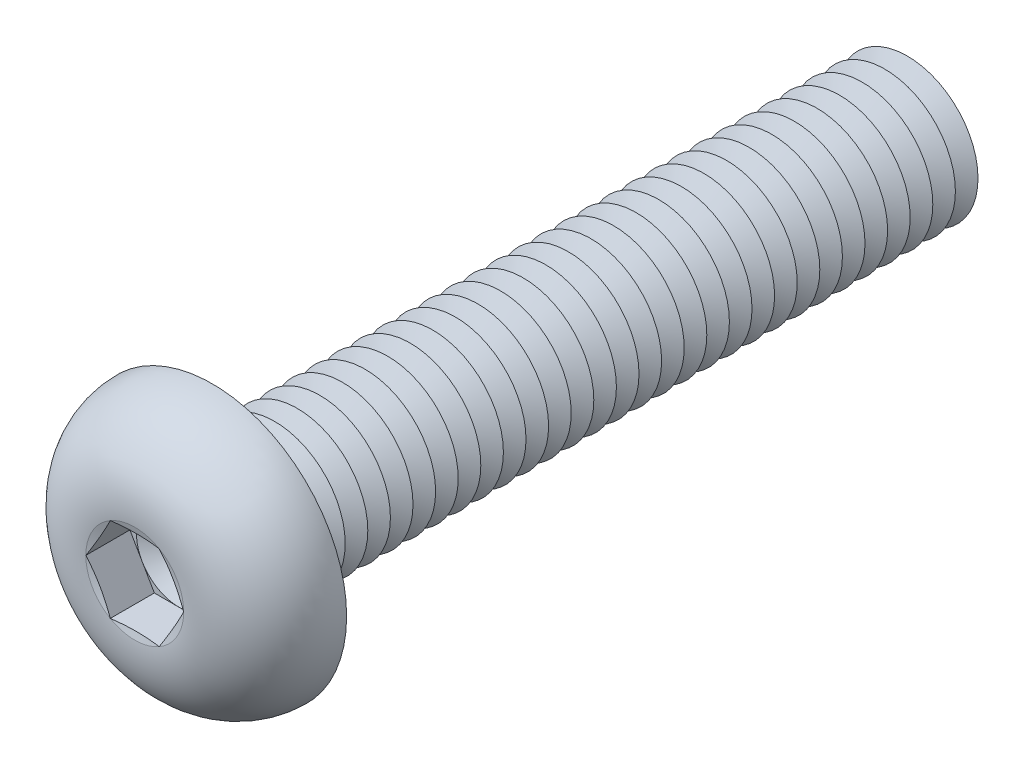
from build123d import *

# Parameters (mm, degrees)
FILLET1_R          = 0.4
LPATTERN1_COUNT    = 31
LPATTERN1_PITCH    = 0.8
CUT_EXTRUDE1_DEPTH = 1.56


with BuildPart() as part:
    # Sketch1 → Revolve1 (revolve)
    with BuildSketch(Plane(origin=(0, 0, 0), x_dir=(0, 0, -1), z_dir=(1, 0, 0)), mode=Mode.PRIVATE) as revolve1_sk:
        with BuildLine():
            Line((0, 2.5), (0, 4.75))
            ThreePointArc((0, 4.75), (-2.041477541, 3.848329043), (-2.75, 1.73205))
            Line((-2.75, 1.73205), (-2.517949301, 0.866025))
            Line((-2.517949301, 0.866025), (-2.75, 0.866025))
            Line((-2.75, 0.866025), (-2.75, 0))
            Line((-2.75, 0), (25, 0))
            Line((25, 0), (25, 2.5))
            Line((25, 2.5), (0, 2.5))
        make_face()
    revolve(revolve1_sk.sketch.rotate(Axis((0, 0, -25), (0, 0, 1)), 90), axis=Axis((0, 0, -25), (0, 0, 1)))

    # Fillet1
    fillet1_edges = [part.edges().sort_by_distance(p)[0] for p in [
        (2.5, 0, 0),
    ]]
    fillet(fillet1_edges, radius=FILLET1_R)

    # Sketch2 → Cut-Revolve1 (revolve, cut)
    with BuildSketch(Plane(origin=(0, 0, 0), x_dir=(0, 0, -1), z_dir=(1, 0, 0)), mode=Mode.PRIVATE) as cut_revolve1_sk:
        Polygon((24.6, 2.5), (25.4, 2.5), (25, 1.807179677), align=None)
    cut_revolve1 = revolve(cut_revolve1_sk.sketch.rotate(Axis((0, 0, -25), (0, 0, -1)), 270), axis=Axis((0, 0, -25), (0, 0, -1)), mode=Mode.SUBTRACT)

    # LPattern1: Cut-Revolve1 ×31
    with Locations(*[(0, 0, i * LPATTERN1_PITCH) for i in range(1, LPATTERN1_COUNT)]):
        add(cut_revolve1, mode=Mode.SUBTRACT)

    # Sketch3 → Cut-Extrude1 (cut)
    with BuildSketch(Plane.XY.offset(2.75)):
        Polygon((0.866025, 1.499999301), (-0.866025, 1.499999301), (-1.73205, 0), (-0.866025, -1.499999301), (0.866025, -1.499999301), (1.73205, 0), align=None)
    extrude(amount=-CUT_EXTRUDE1_DEPTH, mode=Mode.SUBTRACT)

    # Cut-Extrude2 cone 1 section (on through the dimple's axis) → Cut-Extrude2 (revolve, cut)
    with BuildSketch(Plane(origin=(0, 0, 1.19), x_dir=(0, -1, 0), z_dir=(1, 0, 0))):
        Polygon((0, 0), (1.499999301, 0), (0, 0.866025), align=None)
    revolve(axis=Axis((0, 0, 1.19), (0, 0, -1)), mode=Mode.SUBTRACT)


solid = part.part
